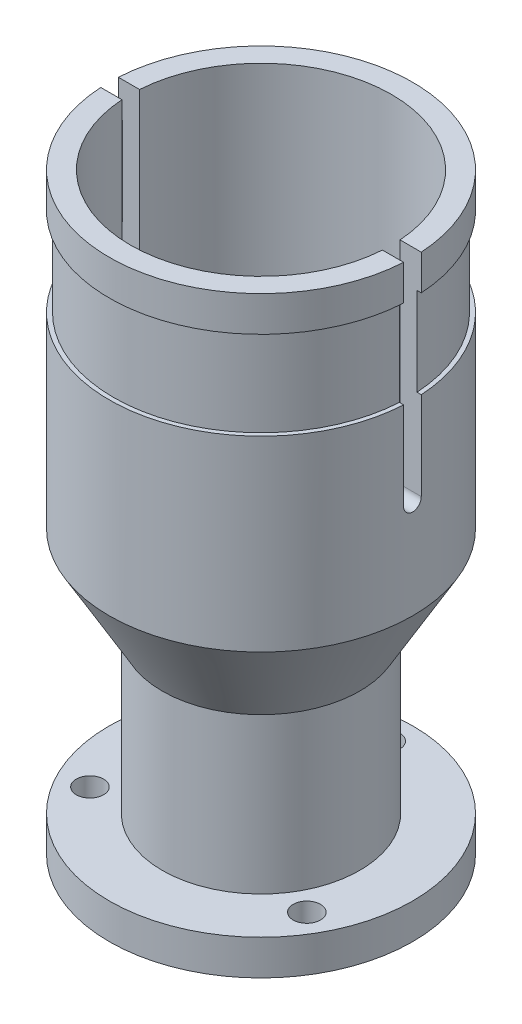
ISO-10303-21;
HEADER;
FILE_DESCRIPTION(('STEP AP214'),'2;1');
FILE_NAME('part.step','',(''),(''),'','','');
FILE_SCHEMA(('AUTOMOTIVE_DESIGN { 1 0 10303 214 1 1 1 1 }'));
ENDSEC;
DATA;
#1=APPLICATION_CONTEXT('core data for automotive mechanical design processes');
#2=APPLICATION_PROTOCOL_DEFINITION('international standard','automotive_design',2000,#1);
#3=PRODUCT_CONTEXT('',#1,'mechanical');
#4=PRODUCT('Part','Part','',(#3));
#5=PRODUCT_RELATED_PRODUCT_CATEGORY('part','',(#4));
#6=PRODUCT_DEFINITION_FORMATION('','',#4);
#7=PRODUCT_DEFINITION_CONTEXT('part definition',#1,'design');
#8=PRODUCT_DEFINITION('design','',#6,#7);
#9=PRODUCT_DEFINITION_SHAPE('','',#8);
#10=(LENGTH_UNIT() NAMED_UNIT(*) SI_UNIT(.MILLI.,.METRE.));
#11=(NAMED_UNIT(*) PLANE_ANGLE_UNIT() SI_UNIT($,.RADIAN.));
#12=(NAMED_UNIT(*) SI_UNIT($,.STERADIAN.) SOLID_ANGLE_UNIT());
#13=UNCERTAINTY_MEASURE_WITH_UNIT(LENGTH_MEASURE(1.E-05),#10,'distance_accuracy_value','');
#14=(GEOMETRIC_REPRESENTATION_CONTEXT(3) GLOBAL_UNCERTAINTY_ASSIGNED_CONTEXT((#13)) GLOBAL_UNIT_ASSIGNED_CONTEXT((#10,
#11,#12)) REPRESENTATION_CONTEXT('',''));
#15=CARTESIAN_POINT('',(0.,0.,0.));
#16=DIRECTION('',(0.,0.,1.));
#17=DIRECTION('',(1.,0.,0.));
#18=AXIS2_PLACEMENT_3D('',#15,#16,#17);
#19=CARTESIAN_POINT('',(-23.495,106.68,0.));
#20=DIRECTION('',(0.,-1.,0.));
#21=DIRECTION('',(0.,0.,-1.));
#22=AXIS2_PLACEMENT_3D('',#19,#20,#21);
#23=PLANE('',#22);
#24=CARTESIAN_POINT('',(0.,106.68,0.));
#25=DIRECTION('',(0.,-1.,0.));
#26=DIRECTION('',(0.,0.,-1.));
#27=AXIS2_PLACEMENT_3D('',#24,#25,#26);
#28=CIRCLE('',#27,27.305);
#29=CARTESIAN_POINT('',(27.2588126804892,106.68,1.5875));
#30=VERTEX_POINT('',#29);
#31=CARTESIAN_POINT('',(-27.2588126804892,106.68,1.5875));
#32=VERTEX_POINT('',#31);
#33=EDGE_CURVE('E223',#30,#32,#28,.T.);
#34=ORIENTED_EDGE('',*,*,#33,.F.);
#35=DIRECTION('',(-1.,0.,0.));
#36=VECTOR('',#35,1.);
#37=CARTESIAN_POINT('',(-23.495,106.68,1.5875));
#38=LINE('',#37,#36);
#39=CARTESIAN_POINT('',(23.4413068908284,106.68,1.5875));
#40=VERTEX_POINT('',#39);
#41=EDGE_CURVE('E277',#30,#40,#38,.T.);
#42=ORIENTED_EDGE('',*,*,#41,.T.);
#43=CARTESIAN_POINT('',(0.,106.68,0.));
#44=DIRECTION('',(0.,-1.,0.));
#45=DIRECTION('',(0.,0.,-1.));
#46=AXIS2_PLACEMENT_3D('',#43,#44,#45);
#47=CIRCLE('',#46,23.495);
#48=CARTESIAN_POINT('',(-23.4413068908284,106.68,1.5875));
#49=VERTEX_POINT('',#48);
#50=EDGE_CURVE('E268',#40,#49,#47,.T.);
#51=ORIENTED_EDGE('',*,*,#50,.T.);
#52=EDGE_CURVE('E276',#49,#32,#38,.T.);
#53=ORIENTED_EDGE('',*,*,#52,.T.);
#54=EDGE_LOOP('',(#34,#42,#51,#53));
#55=FACE_BOUND('',#54,.T.);
#56=ADVANCED_FACE('F35',(#55),#23,.F.);
#57=CARTESIAN_POINT('',(0.,0.,0.));
#58=DIRECTION('',(0.,-1.,0.));
#59=DIRECTION('',(0.,0.,-1.));
#60=AXIS2_PLACEMENT_3D('',#57,#58,#59);
#61=CYLINDRICAL_SURFACE('',#60,27.305);
#62=ORIENTED_EDGE('',*,*,#33,.T.);
#63=DIRECTION('',(0.,-1.,0.));
#64=VECTOR('',#63,1.);
#65=CARTESIAN_POINT('',(-27.2588126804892,0.,1.5875));
#66=LINE('',#65,#64);
#67=CARTESIAN_POINT('',(-27.2588126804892,100.33,1.5875));
#68=VERTEX_POINT('',#67);
#69=EDGE_CURVE('E329',#32,#68,#66,.T.);
#70=ORIENTED_EDGE('',*,*,#69,.T.);
#71=CARTESIAN_POINT('',(0.,100.33,0.));
#72=DIRECTION('',(0.,-1.,0.));
#73=DIRECTION('',(0.,0.,-1.));
#74=AXIS2_PLACEMENT_3D('',#71,#72,#73);
#75=CIRCLE('',#74,27.305);
#76=CARTESIAN_POINT('',(27.2588126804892,100.33,1.5875));
#77=VERTEX_POINT('',#76);
#78=EDGE_CURVE('E230',#77,#68,#75,.T.);
#79=ORIENTED_EDGE('',*,*,#78,.F.);
#80=DIRECTION('',(0.,-1.,0.));
#81=VECTOR('',#80,1.);
#82=CARTESIAN_POINT('',(27.2588126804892,0.,1.5875));
#83=LINE('',#82,#81);
#84=EDGE_CURVE('E316',#77,#30,#83,.F.);
#85=ORIENTED_EDGE('',*,*,#84,.T.);
#86=EDGE_LOOP('',(#62,#70,#79,#85));
#87=FACE_BOUND('',#86,.T.);
#88=ADVANCED_FACE('F369',(#87),#61,.T.);
#89=CARTESIAN_POINT('',(-27.305,100.33,0.));
#90=DIRECTION('',(0.,1.,0.));
#91=DIRECTION('',(0.,0.,1.));
#92=AXIS2_PLACEMENT_3D('',#89,#90,#91);
#93=PLANE('',#92);
#94=ORIENTED_EDGE('',*,*,#78,.T.);
#95=DIRECTION('',(1.,0.,0.));
#96=VECTOR('',#95,1.);
#97=CARTESIAN_POINT('',(-27.305,100.33,1.5875));
#98=LINE('',#97,#96);
#99=CARTESIAN_POINT('',(-26.4954843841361,100.33,1.5875));
#100=VERTEX_POINT('',#99);
#101=EDGE_CURVE('E322',#68,#100,#98,.T.);
#102=ORIENTED_EDGE('',*,*,#101,.T.);
#103=CARTESIAN_POINT('',(0.,100.33,0.));
#104=DIRECTION('',(0.,-1.,0.));
#105=DIRECTION('',(0.,0.,-1.));
#106=AXIS2_PLACEMENT_3D('',#103,#104,#105);
#107=CIRCLE('',#106,26.543);
#108=CARTESIAN_POINT('',(26.4954843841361,100.33,1.5875));
#109=VERTEX_POINT('',#108);
#110=EDGE_CURVE('E234',#109,#100,#107,.T.);
#111=ORIENTED_EDGE('',*,*,#110,.F.);
#112=EDGE_CURVE('E318',#109,#77,#98,.T.);
#113=ORIENTED_EDGE('',*,*,#112,.T.);
#114=EDGE_LOOP('',(#94,#102,#111,#113));
#115=FACE_BOUND('',#114,.T.);
#116=ADVANCED_FACE('F342',(#115),#93,.F.);
#117=CARTESIAN_POINT('',(0.,0.,0.));
#118=DIRECTION('',(0.,-1.,0.));
#119=DIRECTION('',(0.,0.,-1.));
#120=AXIS2_PLACEMENT_3D('',#117,#118,#119);
#121=CYLINDRICAL_SURFACE('',#120,26.543);
#122=ORIENTED_EDGE('',*,*,#110,.T.);
#123=DIRECTION('',(0.,-1.,0.));
#124=VECTOR('',#123,1.);
#125=CARTESIAN_POINT('',(-26.4954843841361,0.,1.5875));
#126=LINE('',#125,#124);
#127=CARTESIAN_POINT('',(-26.4954843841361,84.455,1.5875));
#128=VERTEX_POINT('',#127);
#129=EDGE_CURVE('E331',#100,#128,#126,.T.);
#130=ORIENTED_EDGE('',*,*,#129,.T.);
#131=CARTESIAN_POINT('',(0.,84.455,0.));
#132=DIRECTION('',(0.,-1.,0.));
#133=DIRECTION('',(0.,0.,-1.));
#134=AXIS2_PLACEMENT_3D('',#131,#132,#133);
#135=CIRCLE('',#134,26.543);
#136=CARTESIAN_POINT('',(26.4954843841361,84.455,1.5875));
#137=VERTEX_POINT('',#136);
#138=EDGE_CURVE('E238',#137,#128,#135,.T.);
#139=ORIENTED_EDGE('',*,*,#138,.F.);
#140=DIRECTION('',(0.,-1.,0.));
#141=VECTOR('',#140,1.);
#142=CARTESIAN_POINT('',(26.4954843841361,0.,1.5875));
#143=LINE('',#142,#141);
#144=EDGE_CURVE('E321',#137,#109,#143,.F.);
#145=ORIENTED_EDGE('',*,*,#144,.T.);
#146=EDGE_LOOP('',(#122,#130,#139,#145));
#147=FACE_BOUND('',#146,.T.);
#148=ADVANCED_FACE('F345',(#147),#121,.T.);
#149=CARTESIAN_POINT('',(-26.543,84.455,0.));
#150=DIRECTION('',(0.,-1.,0.));
#151=DIRECTION('',(0.,0.,-1.));
#152=AXIS2_PLACEMENT_3D('',#149,#150,#151);
#153=PLANE('',#152);
#154=CARTESIAN_POINT('',(0.,84.455,0.));
#155=DIRECTION('',(0.,-1.,0.));
#156=DIRECTION('',(0.,0.,-1.));
#157=AXIS2_PLACEMENT_3D('',#154,#155,#156);
#158=CIRCLE('',#157,27.305);
#159=CARTESIAN_POINT('',(27.2588126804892,84.455,1.5875));
#160=VERTEX_POINT('',#159);
#161=CARTESIAN_POINT('',(-27.2588126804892,84.455,1.5875));
#162=VERTEX_POINT('',#161);
#163=EDGE_CURVE('E242',#160,#162,#158,.T.);
#164=ORIENTED_EDGE('',*,*,#163,.F.);
#165=DIRECTION('',(-1.,0.,0.));
#166=VECTOR('',#165,1.);
#167=CARTESIAN_POINT('',(-26.543,84.455,1.5875));
#168=LINE('',#167,#166);
#169=EDGE_CURVE('E325',#160,#137,#168,.T.);
#170=ORIENTED_EDGE('',*,*,#169,.T.);
#171=ORIENTED_EDGE('',*,*,#138,.T.);
#172=EDGE_CURVE('E175',#128,#162,#168,.T.);
#173=ORIENTED_EDGE('',*,*,#172,.T.);
#174=EDGE_LOOP('',(#164,#170,#171,#173));
#175=FACE_BOUND('',#174,.T.);
#176=ADVANCED_FACE('F348',(#175),#153,.F.);
#177=CARTESIAN_POINT('',(-27.2588126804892,106.68,-1.5875));
#178=VERTEX_POINT('',#177);
#179=CARTESIAN_POINT('',(27.2588126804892,106.68,-1.5875));
#180=VERTEX_POINT('',#179);
#181=EDGE_CURVE('E226',#178,#180,#28,.T.);
#182=ORIENTED_EDGE('',*,*,#181,.F.);
#183=DIRECTION('',(1.,0.,0.));
#184=VECTOR('',#183,1.);
#185=CARTESIAN_POINT('',(-23.495,106.68,-1.5875));
#186=LINE('',#185,#184);
#187=CARTESIAN_POINT('',(-23.4413068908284,106.68,-1.5875));
#188=VERTEX_POINT('',#187);
#189=EDGE_CURVE('E287',#178,#188,#186,.T.);
#190=ORIENTED_EDGE('',*,*,#189,.T.);
#191=CARTESIAN_POINT('',(23.4413068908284,106.68,-1.5875));
#192=VERTEX_POINT('',#191);
#193=EDGE_CURVE('E173',#188,#192,#47,.T.);
#194=ORIENTED_EDGE('',*,*,#193,.T.);
#195=EDGE_CURVE('E58',#192,#180,#186,.T.);
#196=ORIENTED_EDGE('',*,*,#195,.T.);
#197=EDGE_LOOP('',(#182,#190,#194,#196));
#198=FACE_BOUND('',#197,.T.);
#199=ADVANCED_FACE('F37',(#198),#23,.F.);
#200=ORIENTED_EDGE('',*,*,#181,.T.);
#201=DIRECTION('',(0.,-1.,0.));
#202=VECTOR('',#201,1.);
#203=CARTESIAN_POINT('',(27.2588126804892,0.,-1.5875));
#204=LINE('',#203,#202);
#205=CARTESIAN_POINT('',(27.2588126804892,100.33,-1.5875));
#206=VERTEX_POINT('',#205);
#207=EDGE_CURVE('E306',#180,#206,#204,.T.);
#208=ORIENTED_EDGE('',*,*,#207,.T.);
#209=CARTESIAN_POINT('',(-27.2588126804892,100.33,-1.5875));
#210=VERTEX_POINT('',#209);
#211=EDGE_CURVE('E231',#210,#206,#75,.T.);
#212=ORIENTED_EDGE('',*,*,#211,.F.);
#213=DIRECTION('',(0.,-1.,0.));
#214=VECTOR('',#213,1.);
#215=CARTESIAN_POINT('',(-27.2588126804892,0.,-1.5875));
#216=LINE('',#215,#214);
#217=EDGE_CURVE('E294',#210,#178,#216,.F.);
#218=ORIENTED_EDGE('',*,*,#217,.T.);
#219=EDGE_LOOP('',(#200,#208,#212,#218));
#220=FACE_BOUND('',#219,.T.);
#221=ADVANCED_FACE('F362',(#220),#61,.T.);
#222=ORIENTED_EDGE('',*,*,#211,.T.);
#223=DIRECTION('',(-1.,0.,0.));
#224=VECTOR('',#223,1.);
#225=CARTESIAN_POINT('',(-27.305,100.33,-1.5875));
#226=LINE('',#225,#224);
#227=CARTESIAN_POINT('',(26.4954843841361,100.33,-1.5875));
#228=VERTEX_POINT('',#227);
#229=EDGE_CURVE('E301',#206,#228,#226,.T.);
#230=ORIENTED_EDGE('',*,*,#229,.T.);
#231=CARTESIAN_POINT('',(-26.4954843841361,100.33,-1.5875));
#232=VERTEX_POINT('',#231);
#233=EDGE_CURVE('E235',#232,#228,#107,.T.);
#234=ORIENTED_EDGE('',*,*,#233,.F.);
#235=EDGE_CURVE('E297',#232,#210,#226,.T.);
#236=ORIENTED_EDGE('',*,*,#235,.T.);
#237=EDGE_LOOP('',(#222,#230,#234,#236));
#238=FACE_BOUND('',#237,.T.);
#239=ADVANCED_FACE('F359',(#238),#93,.F.);
#240=ORIENTED_EDGE('',*,*,#233,.T.);
#241=DIRECTION('',(0.,-1.,0.));
#242=VECTOR('',#241,1.);
#243=CARTESIAN_POINT('',(26.4954843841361,0.,-1.5875));
#244=LINE('',#243,#242);
#245=CARTESIAN_POINT('',(26.4954843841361,84.455,-1.5875));
#246=VERTEX_POINT('',#245);
#247=EDGE_CURVE('E309',#228,#246,#244,.T.);
#248=ORIENTED_EDGE('',*,*,#247,.T.);
#249=CARTESIAN_POINT('',(-26.4954843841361,84.455,-1.5875));
#250=VERTEX_POINT('',#249);
#251=EDGE_CURVE('E239',#250,#246,#135,.T.);
#252=ORIENTED_EDGE('',*,*,#251,.F.);
#253=DIRECTION('',(0.,-1.,0.));
#254=VECTOR('',#253,1.);
#255=CARTESIAN_POINT('',(-26.4954843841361,0.,-1.5875));
#256=LINE('',#255,#254);
#257=EDGE_CURVE('E300',#250,#232,#256,.F.);
#258=ORIENTED_EDGE('',*,*,#257,.T.);
#259=EDGE_LOOP('',(#240,#248,#252,#258));
#260=FACE_BOUND('',#259,.T.);
#261=ADVANCED_FACE('F355',(#260),#121,.T.);
#262=CARTESIAN_POINT('',(-27.2588126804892,84.455,-1.5875));
#263=VERTEX_POINT('',#262);
#264=CARTESIAN_POINT('',(27.2588126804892,84.455,-1.5875));
#265=VERTEX_POINT('',#264);
#266=EDGE_CURVE('E243',#263,#265,#158,.T.);
#267=ORIENTED_EDGE('',*,*,#266,.F.);
#268=DIRECTION('',(1.,0.,0.));
#269=VECTOR('',#268,1.);
#270=CARTESIAN_POINT('',(-26.543,84.455,-1.5875));
#271=LINE('',#270,#269);
#272=EDGE_CURVE('E149',#263,#250,#271,.T.);
#273=ORIENTED_EDGE('',*,*,#272,.T.);
#274=ORIENTED_EDGE('',*,*,#251,.T.);
#275=EDGE_CURVE('E304',#246,#265,#271,.T.);
#276=ORIENTED_EDGE('',*,*,#275,.T.);
#277=EDGE_LOOP('',(#267,#273,#274,#276));
#278=FACE_BOUND('',#277,.T.);
#279=ADVANCED_FACE('F352',(#278),#153,.F.);
#280=CARTESIAN_POINT('',(0.,0.,0.));
#281=DIRECTION('',(0.,-1.,0.));
#282=DIRECTION('',(0.,0.,-1.));
#283=AXIS2_PLACEMENT_3D('',#280,#281,#282);
#284=CYLINDRICAL_SURFACE('',#283,27.305);
#285=CARTESIAN_POINT('',(0.,50.8,0.));
#286=DIRECTION('',(0.,-1.,0.));
#287=DIRECTION('',(0.,0.,-1.));
#288=AXIS2_PLACEMENT_3D('',#285,#286,#287);
#289=CIRCLE('',#288,27.305);
#290=CARTESIAN_POINT('',(0.,50.8,-27.305));
#291=VERTEX_POINT('',#290);
#292=EDGE_CURVE('E245',#291,#291,#289,.T.);
#293=ORIENTED_EDGE('',*,*,#292,.F.);
#294=EDGE_LOOP('',(#293));
#295=FACE_BOUND('',#294,.T.);
#296=CARTESIAN_POINT('',(27.2588126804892,68.58,-1.5875));
#297=CARTESIAN_POINT('',(27.2588120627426,68.5353773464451,-1.58749974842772));
#298=CARTESIAN_POINT('',(27.2589223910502,68.4907761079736,-1.5856173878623));
#299=CARTESIAN_POINT('',(27.2593584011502,68.4018935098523,-1.57810817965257));
#300=CARTESIAN_POINT('',(27.2596840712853,68.3576121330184,-1.57248153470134));
#301=CARTESIAN_POINT('',(27.2609728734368,68.2258025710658,-1.55003940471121));
#302=CARTESIAN_POINT('',(27.2622478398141,68.1391585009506,-1.52766157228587));
#303=CARTESIAN_POINT('',(27.2654874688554,67.9708686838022,-1.46869990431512));
#304=CARTESIAN_POINT('',(27.2674524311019,67.8892251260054,-1.43210989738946));
#305=CARTESIAN_POINT('',(27.2718497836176,67.7332408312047,-1.34576952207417));
#306=CARTESIAN_POINT('',(27.2742820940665,67.6588988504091,-1.29602140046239));
#307=CARTESIAN_POINT('',(27.279343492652,67.5195387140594,-1.18471142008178));
#308=CARTESIAN_POINT('',(27.2819727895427,67.4545306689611,-1.12313691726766));
#309=CARTESIAN_POINT('',(27.2871302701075,67.3357575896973,-0.98993933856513));
#310=CARTESIAN_POINT('',(27.2896584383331,67.2819942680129,-0.918314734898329));
#311=CARTESIAN_POINT('',(27.29433026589,67.1872162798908,-0.766997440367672));
#312=CARTESIAN_POINT('',(27.2964736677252,67.1462101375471,-0.687299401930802));
#313=CARTESIAN_POINT('',(27.3001320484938,67.0781671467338,-0.522140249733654));
#314=CARTESIAN_POINT('',(27.3016470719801,67.051129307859,-0.436679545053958));
#315=CARTESIAN_POINT('',(27.3038766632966,67.0118160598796,-0.262518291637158));
#316=CARTESIAN_POINT('',(27.3045921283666,66.9995241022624,-0.1738214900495));
#317=CARTESIAN_POINT('',(27.305145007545,66.9900003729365,0.004381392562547));
#318=CARTESIAN_POINT('',(27.3049824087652,66.9927688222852,0.0938874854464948));
#319=CARTESIAN_POINT('',(27.30379820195,67.0132741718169,0.271051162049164));
#320=CARTESIAN_POINT('',(27.3027776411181,67.0309928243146,0.358710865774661));
#321=CARTESIAN_POINT('',(27.2999936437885,67.0808672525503,0.529809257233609));
#322=CARTESIAN_POINT('',(27.2982302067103,67.1130230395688,0.613247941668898));
#323=CARTESIAN_POINT('',(27.2941571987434,67.190880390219,0.77359645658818));
#324=CARTESIAN_POINT('',(27.2918472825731,67.2365905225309,0.850502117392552));
#325=CARTESIAN_POINT('',(27.286941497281,67.3402506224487,0.995551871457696));
#326=CARTESIAN_POINT('',(27.2843456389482,67.3982001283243,1.06369629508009));
#327=CARTESIAN_POINT('',(27.2791558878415,67.5247876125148,1.18939073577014));
#328=CARTESIAN_POINT('',(27.2765620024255,67.5934398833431,1.24692635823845));
#329=CARTESIAN_POINT('',(27.2716712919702,67.7394639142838,1.3496761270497));
#330=CARTESIAN_POINT('',(27.2693745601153,67.8168383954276,1.39488641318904));
#331=CARTESIAN_POINT('',(27.2653372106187,67.9781293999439,1.47169902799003));
#332=CARTESIAN_POINT('',(27.2635969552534,68.0620501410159,1.50329249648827));
#333=CARTESIAN_POINT('',(27.2608743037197,68.2339527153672,1.55188900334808));
#334=CARTESIAN_POINT('',(27.2598907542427,68.3219281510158,1.56891424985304));
#335=CARTESIAN_POINT('',(27.2591639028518,68.4387489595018,1.58145855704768));
#336=CARTESIAN_POINT('',(27.2590322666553,68.4669763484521,1.58372527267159));
#337=CARTESIAN_POINT('',(27.2588567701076,68.5234653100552,1.58674393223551));
#338=CARTESIAN_POINT('',(27.2588127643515,68.551726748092,1.58749838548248));
#339=CARTESIAN_POINT('',(27.2588126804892,68.58,1.5875));
#340=B_SPLINE_CURVE_WITH_KNOTS('',3,(#296,#297,#298,#299,#300,#301,#302,#303,#304,#305,#306,
#307,#308,#309,#310,#311,#312,#313,#314,#315,#316,#317,#318,#319,#320,#321,#322,#323,#324,#325,
#326,#327,#328,#329,#330,#331,#332,#333,#334,#335,#336,#337,#338,#339),.UNSPECIFIED.,.F.,.F.,(4,
2,2,2,2,2,2,2,2,2,2,2,2,2,2,2,2,2,2,2,2,4),(0.,0.133785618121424,0.267563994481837,
0.534675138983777,0.801902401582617,1.0690840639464,1.3365529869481,1.60406261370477,
1.87175060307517,2.13941960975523,2.4067879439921,2.6741602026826,2.94120658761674,
3.2082531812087,3.47546895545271,3.74267465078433,4.01024027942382,4.27788961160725,
4.54571283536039,4.81312705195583,4.89805412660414,4.98284016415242),.UNSPECIFIED.);
#341=CARTESIAN_POINT('',(27.2588126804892,68.58,-1.5875));
#342=VERTEX_POINT('',#341);
#343=CARTESIAN_POINT('',(27.2588126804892,68.58,1.5875));
#344=VERTEX_POINT('',#343);
#345=EDGE_CURVE('E171',#342,#344,#340,.T.);
#346=ORIENTED_EDGE('',*,*,#345,.T.);
#347=DIRECTION('',(0.,-1.,0.));
#348=VECTOR('',#347,1.);
#349=CARTESIAN_POINT('',(27.2588126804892,0.,1.5875));
#350=LINE('',#349,#348);
#351=EDGE_CURVE('E284',#344,#160,#350,.F.);
#352=ORIENTED_EDGE('',*,*,#351,.T.);
#353=ORIENTED_EDGE('',*,*,#163,.T.);
#354=DIRECTION('',(0.,-1.,0.));
#355=VECTOR('',#354,1.);
#356=CARTESIAN_POINT('',(-27.2588126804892,0.,1.5875));
#357=LINE('',#356,#355);
#358=CARTESIAN_POINT('',(-27.2588126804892,68.58,1.5875));
#359=VERTEX_POINT('',#358);
#360=EDGE_CURVE('E170',#162,#359,#357,.T.);
#361=ORIENTED_EDGE('',*,*,#360,.T.);
#362=CARTESIAN_POINT('',(-27.2588126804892,68.58,1.5875));
#363=CARTESIAN_POINT('',(-27.2588120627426,68.5353773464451,1.58749974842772));
#364=CARTESIAN_POINT('',(-27.2589223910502,68.4907761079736,1.5856173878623));
#365=CARTESIAN_POINT('',(-27.2593584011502,68.4018935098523,1.57810817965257));
#366=CARTESIAN_POINT('',(-27.2596840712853,68.3576121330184,1.57248153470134));
#367=CARTESIAN_POINT('',(-27.2609728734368,68.2258025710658,1.55003940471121));
#368=CARTESIAN_POINT('',(-27.2622478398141,68.1391585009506,1.52766157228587));
#369=CARTESIAN_POINT('',(-27.2654874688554,67.9708686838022,1.46869990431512));
#370=CARTESIAN_POINT('',(-27.2674524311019,67.8892251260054,1.43210989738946));
#371=CARTESIAN_POINT('',(-27.2718497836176,67.7332408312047,1.34576952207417));
#372=CARTESIAN_POINT('',(-27.2742820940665,67.6588988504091,1.29602140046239));
#373=CARTESIAN_POINT('',(-27.279343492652,67.5195387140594,1.18471142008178));
#374=CARTESIAN_POINT('',(-27.2819727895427,67.4545306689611,1.12313691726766));
#375=CARTESIAN_POINT('',(-27.2871302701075,67.3357575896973,0.98993933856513));
#376=CARTESIAN_POINT('',(-27.2896584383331,67.2819942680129,0.918314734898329));
#377=CARTESIAN_POINT('',(-27.29433026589,67.1872162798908,0.766997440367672));
#378=CARTESIAN_POINT('',(-27.2964736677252,67.1462101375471,0.687299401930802));
#379=CARTESIAN_POINT('',(-27.3001320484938,67.0781671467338,0.522140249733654));
#380=CARTESIAN_POINT('',(-27.3016470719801,67.051129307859,0.436679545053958));
#381=CARTESIAN_POINT('',(-27.3038766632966,67.0118160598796,0.262518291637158));
#382=CARTESIAN_POINT('',(-27.3045921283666,66.9995241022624,0.1738214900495));
#383=CARTESIAN_POINT('',(-27.305145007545,66.9900003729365,-0.004381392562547));
#384=CARTESIAN_POINT('',(-27.3049824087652,66.9927688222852,-0.0938874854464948));
#385=CARTESIAN_POINT('',(-27.30379820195,67.0132741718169,-0.271051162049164));
#386=CARTESIAN_POINT('',(-27.3027776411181,67.0309928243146,-0.358710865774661));
#387=CARTESIAN_POINT('',(-27.2999936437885,67.0808672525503,-0.529809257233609));
#388=CARTESIAN_POINT('',(-27.2982302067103,67.1130230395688,-0.613247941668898));
#389=CARTESIAN_POINT('',(-27.2941571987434,67.190880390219,-0.77359645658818));
#390=CARTESIAN_POINT('',(-27.2918472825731,67.2365905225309,-0.850502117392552));
#391=CARTESIAN_POINT('',(-27.286941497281,67.3402506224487,-0.995551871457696));
#392=CARTESIAN_POINT('',(-27.2843456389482,67.3982001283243,-1.06369629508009));
#393=CARTESIAN_POINT('',(-27.2791558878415,67.5247876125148,-1.18939073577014));
#394=CARTESIAN_POINT('',(-27.2765620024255,67.5934398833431,-1.24692635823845));
#395=CARTESIAN_POINT('',(-27.2716712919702,67.7394639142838,-1.3496761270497));
#396=CARTESIAN_POINT('',(-27.2693745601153,67.8168383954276,-1.39488641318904));
#397=CARTESIAN_POINT('',(-27.2653372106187,67.9781293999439,-1.47169902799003));
#398=CARTESIAN_POINT('',(-27.2635969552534,68.0620501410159,-1.50329249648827));
#399=CARTESIAN_POINT('',(-27.2608743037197,68.2339527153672,-1.55188900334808));
#400=CARTESIAN_POINT('',(-27.2598907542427,68.3219281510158,-1.56891424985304));
#401=CARTESIAN_POINT('',(-27.2591639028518,68.4387489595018,-1.58145855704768));
#402=CARTESIAN_POINT('',(-27.2590322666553,68.4669763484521,-1.58372527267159));
#403=CARTESIAN_POINT('',(-27.2588567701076,68.5234653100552,-1.58674393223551));
#404=CARTESIAN_POINT('',(-27.2588127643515,68.551726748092,-1.58749838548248));
#405=CARTESIAN_POINT('',(-27.2588126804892,68.58,-1.5875));
#406=B_SPLINE_CURVE_WITH_KNOTS('',3,(#362,#363,#364,#365,#366,#367,#368,#369,#370,#371,#372,
#373,#374,#375,#376,#377,#378,#379,#380,#381,#382,#383,#384,#385,#386,#387,#388,#389,#390,#391,
#392,#393,#394,#395,#396,#397,#398,#399,#400,#401,#402,#403,#404,#405),.UNSPECIFIED.,.F.,.F.,(4,
2,2,2,2,2,2,2,2,2,2,2,2,2,2,2,2,2,2,2,2,4),(0.,0.133785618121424,0.267563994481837,
0.534675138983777,0.801902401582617,1.0690840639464,1.3365529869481,1.60406261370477,
1.87175060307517,2.13941960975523,2.4067879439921,2.6741602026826,2.94120658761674,
3.2082531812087,3.47546895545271,3.74267465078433,4.01024027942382,4.27788961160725,
4.54571283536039,4.81312705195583,4.89805412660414,4.98284016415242),.UNSPECIFIED.);
#407=CARTESIAN_POINT('',(-27.2588126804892,68.58,-1.5875));
#408=VERTEX_POINT('',#407);
#409=EDGE_CURVE('E158',#359,#408,#406,.T.);
#410=ORIENTED_EDGE('',*,*,#409,.T.);
#411=DIRECTION('',(0.,-1.,0.));
#412=VECTOR('',#411,1.);
#413=CARTESIAN_POINT('',(-27.2588126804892,0.,-1.5875));
#414=LINE('',#413,#412);
#415=EDGE_CURVE('E146',#408,#263,#414,.F.);
#416=ORIENTED_EDGE('',*,*,#415,.T.);
#417=ORIENTED_EDGE('',*,*,#266,.T.);
#418=DIRECTION('',(0.,-1.,0.));
#419=VECTOR('',#418,1.);
#420=CARTESIAN_POINT('',(27.2588126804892,0.,-1.5875));
#421=LINE('',#420,#419);
#422=EDGE_CURVE('E312',#265,#342,#421,.T.);
#423=ORIENTED_EDGE('',*,*,#422,.T.);
#424=EDGE_LOOP('',(#346,#352,#353,#361,#410,#416,#417,#423));
#425=FACE_BOUND('',#424,.T.);
#426=ADVANCED_FACE('F168',(#295,#425),#284,.T.);
#427=CARTESIAN_POINT('',(0.,50.8,0.));
#428=DIRECTION('',(0.,1.,0.));
#429=DIRECTION('',(0.,0.,1.));
#430=AXIS2_PLACEMENT_3D('',#427,#428,#429);
#431=CONICAL_SURFACE('',#430,27.305,0.523598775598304);
#432=CARTESIAN_POINT('',(0.,34.3022160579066,0.));
#433=DIRECTION('',(0.,-1.,0.));
#434=DIRECTION('',(0.,0.,-1.));
#435=AXIS2_PLACEMENT_3D('',#432,#433,#434);
#436=CIRCLE('',#435,17.78);
#437=CARTESIAN_POINT('',(0.,34.3022160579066,-17.78));
#438=VERTEX_POINT('',#437);
#439=EDGE_CURVE('E248',#438,#438,#436,.T.);
#440=ORIENTED_EDGE('',*,*,#439,.F.);
#441=EDGE_LOOP('',(#440));
#442=FACE_BOUND('',#441,.T.);
#443=ORIENTED_EDGE('',*,*,#292,.T.);
#444=EDGE_LOOP('',(#443));
#445=FACE_BOUND('',#444,.T.);
#446=ADVANCED_FACE('F386',(#442,#445),#431,.T.);
#447=CARTESIAN_POINT('',(0.,0.,0.));
#448=DIRECTION('',(0.,-1.,0.));
#449=DIRECTION('',(0.,0.,-1.));
#450=AXIS2_PLACEMENT_3D('',#447,#448,#449);
#451=CYLINDRICAL_SURFACE('',#450,17.78);
#452=CARTESIAN_POINT('',(0.,6.35,0.));
#453=DIRECTION('',(0.,-1.,0.));
#454=DIRECTION('',(0.,0.,-1.));
#455=AXIS2_PLACEMENT_3D('',#452,#453,#454);
#456=CIRCLE('',#455,17.78);
#457=CARTESIAN_POINT('',(0.,6.35,-17.78));
#458=VERTEX_POINT('',#457);
#459=EDGE_CURVE('E251',#458,#458,#456,.T.);
#460=ORIENTED_EDGE('',*,*,#459,.F.);
#461=EDGE_LOOP('',(#460));
#462=FACE_BOUND('',#461,.T.);
#463=ORIENTED_EDGE('',*,*,#439,.T.);
#464=EDGE_LOOP('',(#463));
#465=FACE_BOUND('',#464,.T.);
#466=ADVANCED_FACE('F391',(#462,#465),#451,.T.);
#467=CARTESIAN_POINT('',(-17.78,6.35,0.));
#468=DIRECTION('',(0.,-1.,0.));
#469=DIRECTION('',(0.,0.,-1.));
#470=AXIS2_PLACEMENT_3D('',#467,#468,#469);
#471=PLANE('',#470);
#472=CARTESIAN_POINT('',(-19.5223776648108,6.35,11.2712499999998));
#473=DIRECTION('',(0.,1.,0.));
#474=DIRECTION('',(0.,0.,1.));
#475=AXIS2_PLACEMENT_3D('',#472,#473,#474);
#476=CIRCLE('',#475,2.45744999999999);
#477=CARTESIAN_POINT('',(-19.5223776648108,6.35,13.7286999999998));
#478=VERTEX_POINT('',#477);
#479=EDGE_CURVE('E470',#478,#478,#476,.T.);
#480=ORIENTED_EDGE('',*,*,#479,.F.);
#481=EDGE_LOOP('',(#480));
#482=FACE_BOUND('',#481,.T.);
#483=CARTESIAN_POINT('',(19.5223776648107,6.35,11.2712500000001));
#484=DIRECTION('',(0.,1.,0.));
#485=DIRECTION('',(0.,0.,1.));
#486=AXIS2_PLACEMENT_3D('',#483,#484,#485);
#487=CIRCLE('',#486,2.45744999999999);
#488=CARTESIAN_POINT('',(19.5223776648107,6.35,13.7287000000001));
#489=VERTEX_POINT('',#488);
#490=EDGE_CURVE('E472',#489,#489,#487,.T.);
#491=ORIENTED_EDGE('',*,*,#490,.F.);
#492=EDGE_LOOP('',(#491));
#493=FACE_BOUND('',#492,.T.);
#494=CARTESIAN_POINT('',(0.,6.35,-22.5425));
#495=DIRECTION('',(0.,1.,0.));
#496=DIRECTION('',(0.,0.,1.));
#497=AXIS2_PLACEMENT_3D('',#494,#495,#496);
#498=CIRCLE('',#497,2.45744999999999);
#499=CARTESIAN_POINT('',(0.,6.35,-20.08505));
#500=VERTEX_POINT('',#499);
#501=EDGE_CURVE('E479',#500,#500,#498,.T.);
#502=ORIENTED_EDGE('',*,*,#501,.F.);
#503=EDGE_LOOP('',(#502));
#504=FACE_BOUND('',#503,.T.);
#505=CARTESIAN_POINT('',(0.,6.35,0.));
#506=DIRECTION('',(0.,-1.,0.));
#507=DIRECTION('',(0.,0.,-1.));
#508=AXIS2_PLACEMENT_3D('',#505,#506,#507);
#509=CIRCLE('',#508,27.305);
#510=CARTESIAN_POINT('',(0.,6.35,-27.305));
#511=VERTEX_POINT('',#510);
#512=EDGE_CURVE('E254',#511,#511,#509,.T.);
#513=ORIENTED_EDGE('',*,*,#512,.F.);
#514=EDGE_LOOP('',(#513));
#515=FACE_BOUND('',#514,.T.);
#516=ORIENTED_EDGE('',*,*,#459,.T.);
#517=EDGE_LOOP('',(#516));
#518=FACE_BOUND('',#517,.T.);
#519=ADVANCED_FACE('F398',(#482,#493,#504,#515,#518),#471,.F.);
#520=CARTESIAN_POINT('',(0.,0.,0.));
#521=DIRECTION('',(0.,-1.,0.));
#522=DIRECTION('',(0.,0.,-1.));
#523=AXIS2_PLACEMENT_3D('',#520,#521,#522);
#524=CYLINDRICAL_SURFACE('',#523,27.305);
#525=CARTESIAN_POINT('',(0.,0.,0.));
#526=DIRECTION('',(0.,-1.,0.));
#527=DIRECTION('',(0.,0.,-1.));
#528=AXIS2_PLACEMENT_3D('',#525,#526,#527);
#529=CIRCLE('',#528,27.305);
#530=CARTESIAN_POINT('',(0.,0.,-27.305));
#531=VERTEX_POINT('',#530);
#532=EDGE_CURVE('E257',#531,#531,#529,.T.);
#533=ORIENTED_EDGE('',*,*,#532,.F.);
#534=EDGE_LOOP('',(#533));
#535=FACE_BOUND('',#534,.T.);
#536=ORIENTED_EDGE('',*,*,#512,.T.);
#537=EDGE_LOOP('',(#536));
#538=FACE_BOUND('',#537,.T.);
#539=ADVANCED_FACE('F405',(#535,#538),#524,.T.);
#540=CARTESIAN_POINT('',(-27.305,0.,0.));
#541=DIRECTION('',(0.,1.,0.));
#542=DIRECTION('',(0.,0.,1.));
#543=AXIS2_PLACEMENT_3D('',#540,#541,#542);
#544=PLANE('',#543);
#545=CARTESIAN_POINT('',(-19.5223776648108,0.,11.2712499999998));
#546=DIRECTION('',(0.,1.,0.));
#547=DIRECTION('',(0.,0.,1.));
#548=AXIS2_PLACEMENT_3D('',#545,#546,#547);
#549=CIRCLE('',#548,2.45745);
#550=CARTESIAN_POINT('',(-19.5223776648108,0.,13.7286999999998));
#551=VERTEX_POINT('',#550);
#552=EDGE_CURVE('E467',#551,#551,#549,.T.);
#553=ORIENTED_EDGE('',*,*,#552,.T.);
#554=EDGE_LOOP('',(#553));
#555=FACE_BOUND('',#554,.T.);
#556=CARTESIAN_POINT('',(19.5223776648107,0.,11.2712500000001));
#557=DIRECTION('',(0.,1.,0.));
#558=DIRECTION('',(0.,0.,1.));
#559=AXIS2_PLACEMENT_3D('',#556,#557,#558);
#560=CIRCLE('',#559,2.45745);
#561=CARTESIAN_POINT('',(19.5223776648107,0.,13.7287000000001));
#562=VERTEX_POINT('',#561);
#563=EDGE_CURVE('E477',#562,#562,#560,.T.);
#564=ORIENTED_EDGE('',*,*,#563,.T.);
#565=EDGE_LOOP('',(#564));
#566=FACE_BOUND('',#565,.T.);
#567=CARTESIAN_POINT('',(0.,0.,-22.5425));
#568=DIRECTION('',(0.,1.,0.));
#569=DIRECTION('',(0.,0.,1.));
#570=AXIS2_PLACEMENT_3D('',#567,#568,#569);
#571=CIRCLE('',#570,2.45745);
#572=CARTESIAN_POINT('',(0.,0.,-20.08505));
#573=VERTEX_POINT('',#572);
#574=EDGE_CURVE('E289',#573,#573,#571,.T.);
#575=ORIENTED_EDGE('',*,*,#574,.T.);
#576=EDGE_LOOP('',(#575));
#577=FACE_BOUND('',#576,.T.);
#578=CARTESIAN_POINT('',(0.,0.,0.));
#579=DIRECTION('',(0.,-1.,0.));
#580=DIRECTION('',(0.,0.,-1.));
#581=AXIS2_PLACEMENT_3D('',#578,#579,#580);
#582=CIRCLE('',#581,12.7);
#583=CARTESIAN_POINT('',(0.,0.,-12.7));
#584=VERTEX_POINT('',#583);
#585=EDGE_CURVE('E260',#584,#584,#582,.T.);
#586=ORIENTED_EDGE('',*,*,#585,.F.);
#587=EDGE_LOOP('',(#586));
#588=FACE_BOUND('',#587,.T.);
#589=ORIENTED_EDGE('',*,*,#532,.T.);
#590=EDGE_LOOP('',(#589));
#591=FACE_BOUND('',#590,.T.);
#592=ADVANCED_FACE('F409',(#555,#566,#577,#588,#591),#544,.F.);
#593=CARTESIAN_POINT('',(0.,0.,0.));
#594=DIRECTION('',(0.,-1.,0.));
#595=DIRECTION('',(0.,0.,-1.));
#596=AXIS2_PLACEMENT_3D('',#593,#594,#595);
#597=CYLINDRICAL_SURFACE('',#596,12.7);
#598=CARTESIAN_POINT('',(0.,55.88,0.));
#599=DIRECTION('',(0.,-1.,0.));
#600=DIRECTION('',(0.,0.,-1.));
#601=AXIS2_PLACEMENT_3D('',#598,#599,#600);
#602=CIRCLE('',#601,12.7);
#603=CARTESIAN_POINT('',(0.,55.88,-12.7));
#604=VERTEX_POINT('',#603);
#605=EDGE_CURVE('E263',#604,#604,#602,.T.);
#606=ORIENTED_EDGE('',*,*,#605,.F.);
#607=EDGE_LOOP('',(#606));
#608=FACE_BOUND('',#607,.T.);
#609=ORIENTED_EDGE('',*,*,#585,.T.);
#610=EDGE_LOOP('',(#609));
#611=FACE_BOUND('',#610,.T.);
#612=ADVANCED_FACE('F413',(#608,#611),#597,.F.);
#613=CARTESIAN_POINT('',(-12.7,55.88,0.));
#614=DIRECTION('',(0.,-1.,0.));
#615=DIRECTION('',(0.,0.,-1.));
#616=AXIS2_PLACEMENT_3D('',#613,#614,#615);
#617=PLANE('',#616);
#618=CARTESIAN_POINT('',(0.,55.88,0.));
#619=DIRECTION('',(0.,-1.,0.));
#620=DIRECTION('',(0.,0.,-1.));
#621=AXIS2_PLACEMENT_3D('',#618,#619,#620);
#622=CIRCLE('',#621,23.495);
#623=CARTESIAN_POINT('',(0.,55.88,-23.495));
#624=VERTEX_POINT('',#623);
#625=EDGE_CURVE('E266',#624,#624,#622,.T.);
#626=ORIENTED_EDGE('',*,*,#625,.F.);
#627=EDGE_LOOP('',(#626));
#628=FACE_BOUND('',#627,.T.);
#629=ORIENTED_EDGE('',*,*,#605,.T.);
#630=EDGE_LOOP('',(#629));
#631=FACE_BOUND('',#630,.T.);
#632=ADVANCED_FACE('F416',(#628,#631),#617,.F.);
#633=CARTESIAN_POINT('',(0.,0.,0.));
#634=DIRECTION('',(0.,-1.,0.));
#635=DIRECTION('',(0.,0.,-1.));
#636=AXIS2_PLACEMENT_3D('',#633,#634,#635);
#637=CYLINDRICAL_SURFACE('',#636,23.495);
#638=ORIENTED_EDGE('',*,*,#50,.F.);
#639=DIRECTION('',(0.,-1.,0.));
#640=VECTOR('',#639,1.);
#641=CARTESIAN_POINT('',(23.4413068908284,0.,1.5875));
#642=LINE('',#641,#640);
#643=CARTESIAN_POINT('',(23.4413068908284,68.58,1.5875));
#644=VERTEX_POINT('',#643);
#645=EDGE_CURVE('E11',#40,#644,#642,.T.);
#646=ORIENTED_EDGE('',*,*,#645,.T.);
#647=CARTESIAN_POINT('',(23.4413068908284,68.58,1.5875));
#648=CARTESIAN_POINT('',(23.4413061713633,68.5353914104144,1.58749976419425));
#649=CARTESIAN_POINT('',(23.4414343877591,68.4908042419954,1.58561857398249));
#650=CARTESIAN_POINT('',(23.4419410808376,68.4019499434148,1.57811413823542));
#651=CARTESIAN_POINT('',(23.4423195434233,68.3576827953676,1.57249110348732));
#652=CARTESIAN_POINT('',(23.4438172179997,68.22591816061,1.55006398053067));
#653=CARTESIAN_POINT('',(23.44529876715,68.1393048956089,1.52770171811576));
#654=CARTESIAN_POINT('',(23.449063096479,67.9710763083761,1.46878378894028));
#655=CARTESIAN_POINT('',(23.4513462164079,67.8894631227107,1.43222210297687));
#656=CARTESIAN_POINT('',(23.4564554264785,67.7335333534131,1.34595088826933));
#657=CARTESIAN_POINT('',(23.459281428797,67.6592155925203,1.29624348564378));
#658=CARTESIAN_POINT('',(23.4651632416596,67.5198672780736,1.1850046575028));
#659=CARTESIAN_POINT('',(23.4682193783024,67.4548502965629,1.12345625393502));
#660=CARTESIAN_POINT('',(23.4742144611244,67.3360528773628,0.990309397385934));
#661=CARTESIAN_POINT('',(23.4771533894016,67.2822741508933,0.918709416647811));
#662=CARTESIAN_POINT('',(23.4825855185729,67.187446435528,0.767416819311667));
#663=CARTESIAN_POINT('',(23.4850783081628,67.1464091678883,0.687716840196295));
#664=CARTESIAN_POINT('',(23.4893335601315,67.0783062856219,0.522543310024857));
#665=CARTESIAN_POINT('',(23.4910960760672,67.0512396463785,0.437070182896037));
#666=CARTESIAN_POINT('',(23.4936900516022,67.0118824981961,0.262910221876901));
#667=CARTESIAN_POINT('',(23.4945229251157,66.9995695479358,0.174228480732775));
#668=CARTESIAN_POINT('',(23.4951685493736,66.9899999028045,-0.00394890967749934));
#669=CARTESIAN_POINT('',(23.4949812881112,66.9927433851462,-0.093444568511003));
#670=CARTESIAN_POINT('',(23.4936088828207,67.0131907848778,-0.27055235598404));
#671=CARTESIAN_POINT('',(23.492425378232,67.0308701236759,-0.358167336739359));
#672=CARTESIAN_POINT('',(23.4891955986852,67.0806491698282,-0.52918286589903));
#673=CARTESIAN_POINT('',(23.4871493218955,67.1127489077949,-0.612583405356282));
#674=CARTESIAN_POINT('',(23.4824214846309,67.19048600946,-0.77288339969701));
#675=CARTESIAN_POINT('',(23.4797393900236,67.2361347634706,-0.849777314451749));
#676=CARTESIAN_POINT('',(23.4740418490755,67.339663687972,-0.99481677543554));
#677=CARTESIAN_POINT('',(23.4710264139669,67.397543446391,-1.0629626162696));
#678=CARTESIAN_POINT('',(23.4649946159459,67.5240206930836,-1.18871007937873));
#679=CARTESIAN_POINT('',(23.4619782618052,67.5926379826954,-1.2462917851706));
#680=CARTESIAN_POINT('',(23.4562893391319,67.7386029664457,-1.34913984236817));
#681=CARTESIAN_POINT('',(23.4536168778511,67.815953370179,-1.39440235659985));
#682=CARTESIAN_POINT('',(23.4489173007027,67.9772118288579,-1.4713240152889));
#683=CARTESIAN_POINT('',(23.4468906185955,68.061124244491,-1.50297402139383));
#684=CARTESIAN_POINT('',(23.4437179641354,68.2330245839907,-1.55168255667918));
#685=CARTESIAN_POINT('',(23.4425706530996,68.3210060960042,-1.56876326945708));
#686=CARTESIAN_POINT('',(23.4417197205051,68.4379887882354,-1.58139323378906));
#687=CARTESIAN_POINT('',(23.441564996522,68.4663675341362,-1.58368444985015));
#688=CARTESIAN_POINT('',(23.4413587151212,68.5231603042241,-1.58673575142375));
#689=CARTESIAN_POINT('',(23.4413069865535,68.5515741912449,-1.58749837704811));
#690=CARTESIAN_POINT('',(23.4413068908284,68.58,-1.5875));
#691=B_SPLINE_CURVE_WITH_KNOTS('',3,(#647,#648,#649,#650,#651,#652,#653,#654,#655,#656,#657,
#658,#659,#660,#661,#662,#663,#664,#665,#666,#667,#668,#669,#670,#671,#672,#673,#674,#675,#676,
#677,#678,#679,#680,#681,#682,#683,#684,#685,#686,#687,#688,#689,#690),.UNSPECIFIED.,.F.,.F.,(4,
2,2,2,2,2,2,2,2,2,2,2,2,2,2,2,2,2,2,2,2,4),(0.,0.13374341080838,0.267479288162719,
0.534499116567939,0.801632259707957,1.06872222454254,1.33619804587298,1.6037145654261,
1.87147645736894,2.13921870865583,2.40655318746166,2.67389081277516,2.94078935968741,
3.20768847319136,3.47481260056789,3.74192772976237,4.00954138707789,4.27723830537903,
4.54511465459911,4.81258239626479,4.89796771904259,4.98321103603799),.UNSPECIFIED.);
#692=CARTESIAN_POINT('',(23.4413068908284,68.58,-1.5875));
#693=VERTEX_POINT('',#692);
#694=EDGE_CURVE('E43',#644,#693,#691,.T.);
#695=ORIENTED_EDGE('',*,*,#694,.T.);
#696=DIRECTION('',(0.,-1.,0.));
#697=VECTOR('',#696,1.);
#698=CARTESIAN_POINT('',(23.4413068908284,0.,-1.5875));
#699=LINE('',#698,#697);
#700=EDGE_CURVE('E216',#693,#192,#699,.F.);
#701=ORIENTED_EDGE('',*,*,#700,.T.);
#702=ORIENTED_EDGE('',*,*,#193,.F.);
#703=DIRECTION('',(0.,-1.,0.));
#704=VECTOR('',#703,1.);
#705=CARTESIAN_POINT('',(-23.4413068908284,0.,-1.5875));
#706=LINE('',#705,#704);
#707=CARTESIAN_POINT('',(-23.4413068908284,68.58,-1.5875));
#708=VERTEX_POINT('',#707);
#709=EDGE_CURVE('E222',#188,#708,#706,.T.);
#710=ORIENTED_EDGE('',*,*,#709,.T.);
#711=CARTESIAN_POINT('',(-23.4413068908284,68.58,-1.5875));
#712=CARTESIAN_POINT('',(-23.4413061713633,68.5353914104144,-1.58749976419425));
#713=CARTESIAN_POINT('',(-23.4414343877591,68.4908042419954,-1.58561857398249));
#714=CARTESIAN_POINT('',(-23.4419410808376,68.4019499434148,-1.57811413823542));
#715=CARTESIAN_POINT('',(-23.4423195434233,68.3576827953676,-1.57249110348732));
#716=CARTESIAN_POINT('',(-23.4438172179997,68.22591816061,-1.55006398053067));
#717=CARTESIAN_POINT('',(-23.44529876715,68.1393048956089,-1.52770171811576));
#718=CARTESIAN_POINT('',(-23.449063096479,67.9710763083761,-1.46878378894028));
#719=CARTESIAN_POINT('',(-23.4513462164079,67.8894631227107,-1.43222210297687));
#720=CARTESIAN_POINT('',(-23.4564554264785,67.7335333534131,-1.34595088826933));
#721=CARTESIAN_POINT('',(-23.459281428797,67.6592155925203,-1.29624348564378));
#722=CARTESIAN_POINT('',(-23.4651632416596,67.5198672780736,-1.1850046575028));
#723=CARTESIAN_POINT('',(-23.4682193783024,67.4548502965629,-1.12345625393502));
#724=CARTESIAN_POINT('',(-23.4742144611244,67.3360528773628,-0.990309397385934));
#725=CARTESIAN_POINT('',(-23.4771533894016,67.2822741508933,-0.918709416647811));
#726=CARTESIAN_POINT('',(-23.4825855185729,67.187446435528,-0.767416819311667));
#727=CARTESIAN_POINT('',(-23.4850783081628,67.1464091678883,-0.687716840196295));
#728=CARTESIAN_POINT('',(-23.4893335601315,67.0783062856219,-0.522543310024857));
#729=CARTESIAN_POINT('',(-23.4910960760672,67.0512396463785,-0.437070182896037));
#730=CARTESIAN_POINT('',(-23.4936900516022,67.0118824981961,-0.262910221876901));
#731=CARTESIAN_POINT('',(-23.4945229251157,66.9995695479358,-0.174228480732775));
#732=CARTESIAN_POINT('',(-23.4951685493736,66.9899999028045,0.00394890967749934));
#733=CARTESIAN_POINT('',(-23.4949812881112,66.9927433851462,0.093444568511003));
#734=CARTESIAN_POINT('',(-23.4936088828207,67.0131907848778,0.27055235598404));
#735=CARTESIAN_POINT('',(-23.492425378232,67.0308701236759,0.358167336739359));
#736=CARTESIAN_POINT('',(-23.4891955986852,67.0806491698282,0.52918286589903));
#737=CARTESIAN_POINT('',(-23.4871493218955,67.1127489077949,0.612583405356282));
#738=CARTESIAN_POINT('',(-23.4824214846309,67.19048600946,0.77288339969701));
#739=CARTESIAN_POINT('',(-23.4797393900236,67.2361347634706,0.849777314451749));
#740=CARTESIAN_POINT('',(-23.4740418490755,67.339663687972,0.99481677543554));
#741=CARTESIAN_POINT('',(-23.4710264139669,67.397543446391,1.0629626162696));
#742=CARTESIAN_POINT('',(-23.4649946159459,67.5240206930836,1.18871007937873));
#743=CARTESIAN_POINT('',(-23.4619782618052,67.5926379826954,1.2462917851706));
#744=CARTESIAN_POINT('',(-23.4562893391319,67.7386029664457,1.34913984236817));
#745=CARTESIAN_POINT('',(-23.4536168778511,67.815953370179,1.39440235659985));
#746=CARTESIAN_POINT('',(-23.4489173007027,67.9772118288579,1.4713240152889));
#747=CARTESIAN_POINT('',(-23.4468906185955,68.061124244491,1.50297402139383));
#748=CARTESIAN_POINT('',(-23.4437179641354,68.2330245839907,1.55168255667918));
#749=CARTESIAN_POINT('',(-23.4425706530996,68.3210060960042,1.56876326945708));
#750=CARTESIAN_POINT('',(-23.4417197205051,68.4379887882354,1.58139323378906));
#751=CARTESIAN_POINT('',(-23.441564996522,68.4663675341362,1.58368444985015));
#752=CARTESIAN_POINT('',(-23.4413587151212,68.5231603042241,1.58673575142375));
#753=CARTESIAN_POINT('',(-23.4413069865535,68.5515741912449,1.58749837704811));
#754=CARTESIAN_POINT('',(-23.4413068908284,68.58,1.5875));
#755=B_SPLINE_CURVE_WITH_KNOTS('',3,(#711,#712,#713,#714,#715,#716,#717,#718,#719,#720,#721,
#722,#723,#724,#725,#726,#727,#728,#729,#730,#731,#732,#733,#734,#735,#736,#737,#738,#739,#740,
#741,#742,#743,#744,#745,#746,#747,#748,#749,#750,#751,#752,#753,#754),.UNSPECIFIED.,.F.,.F.,(4,
2,2,2,2,2,2,2,2,2,2,2,2,2,2,2,2,2,2,2,2,4),(0.,0.13374341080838,0.267479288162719,
0.534499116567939,0.801632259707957,1.06872222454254,1.33619804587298,1.6037145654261,
1.87147645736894,2.13921870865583,2.40655318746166,2.67389081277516,2.94078935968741,
3.20768847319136,3.47481260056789,3.74192772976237,4.00954138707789,4.27723830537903,
4.54511465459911,4.81258239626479,4.89796771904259,4.98321103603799),.UNSPECIFIED.);
#756=CARTESIAN_POINT('',(-23.4413068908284,68.58,1.5875));
#757=VERTEX_POINT('',#756);
#758=EDGE_CURVE('E161',#708,#757,#755,.T.);
#759=ORIENTED_EDGE('',*,*,#758,.T.);
#760=DIRECTION('',(0.,-1.,0.));
#761=VECTOR('',#760,1.);
#762=CARTESIAN_POINT('',(-23.4413068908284,0.,1.5875));
#763=LINE('',#762,#761);
#764=EDGE_CURVE('E217',#757,#49,#763,.F.);
#765=ORIENTED_EDGE('',*,*,#764,.T.);
#766=EDGE_LOOP('',(#638,#646,#695,#701,#702,#710,#759,#765));
#767=FACE_BOUND('',#766,.T.);
#768=ORIENTED_EDGE('',*,*,#625,.T.);
#769=EDGE_LOOP('',(#768));
#770=FACE_BOUND('',#769,.T.);
#771=ADVANCED_FACE('F199',(#767,#770),#637,.F.);
#772=CARTESIAN_POINT('',(-50.8,68.58,-1.5875));
#773=DIRECTION('',(0.,0.,-1.));
#774=DIRECTION('',(0.,1.,0.));
#775=AXIS2_PLACEMENT_3D('',#772,#773,#774);
#776=PLANE('',#775);
#777=DIRECTION('',(1.,0.,0.));
#778=VECTOR('',#777,1.);
#779=CARTESIAN_POINT('',(-50.8,68.58,-1.5875));
#780=LINE('',#779,#778);
#781=EDGE_CURVE('E50',#408,#708,#780,.T.);
#782=ORIENTED_EDGE('',*,*,#781,.T.);
#783=ORIENTED_EDGE('',*,*,#709,.F.);
#784=ORIENTED_EDGE('',*,*,#189,.F.);
#785=ORIENTED_EDGE('',*,*,#217,.F.);
#786=ORIENTED_EDGE('',*,*,#235,.F.);
#787=ORIENTED_EDGE('',*,*,#257,.F.);
#788=ORIENTED_EDGE('',*,*,#272,.F.);
#789=ORIENTED_EDGE('',*,*,#415,.F.);
#790=EDGE_LOOP('',(#782,#783,#784,#785,#786,#787,#788,#789));
#791=FACE_BOUND('',#790,.T.);
#792=ADVANCED_FACE('F147',(#791),#776,.F.);
#793=CARTESIAN_POINT('',(-50.8,68.58,1.5875));
#794=DIRECTION('',(0.,0.,1.));
#795=DIRECTION('',(0.,-1.,0.));
#796=AXIS2_PLACEMENT_3D('',#793,#794,#795);
#797=PLANE('',#796);
#798=ORIENTED_EDGE('',*,*,#172,.F.);
#799=ORIENTED_EDGE('',*,*,#129,.F.);
#800=ORIENTED_EDGE('',*,*,#101,.F.);
#801=ORIENTED_EDGE('',*,*,#69,.F.);
#802=ORIENTED_EDGE('',*,*,#52,.F.);
#803=ORIENTED_EDGE('',*,*,#764,.F.);
#804=DIRECTION('',(1.,0.,0.));
#805=VECTOR('',#804,1.);
#806=CARTESIAN_POINT('',(-50.8,68.58,1.5875));
#807=LINE('',#806,#805);
#808=EDGE_CURVE('E285',#359,#757,#807,.T.);
#809=ORIENTED_EDGE('',*,*,#808,.F.);
#810=ORIENTED_EDGE('',*,*,#360,.F.);
#811=EDGE_LOOP('',(#798,#799,#800,#801,#802,#803,#809,#810));
#812=FACE_BOUND('',#811,.T.);
#813=ADVANCED_FACE('F440',(#812),#797,.F.);
#814=CARTESIAN_POINT('',(-50.8,68.58,0.));
#815=DIRECTION('',(1.,0.,0.));
#816=DIRECTION('',(0.,0.,-1.));
#817=AXIS2_PLACEMENT_3D('',#814,#815,#816);
#818=CYLINDRICAL_SURFACE('',#817,1.5875);
#819=ORIENTED_EDGE('',*,*,#808,.T.);
#820=ORIENTED_EDGE('',*,*,#758,.F.);
#821=ORIENTED_EDGE('',*,*,#781,.F.);
#822=ORIENTED_EDGE('',*,*,#409,.F.);
#823=EDGE_LOOP('',(#819,#820,#821,#822));
#824=FACE_BOUND('',#823,.T.);
#825=ADVANCED_FACE('F157',(#824),#818,.F.);
#826=EDGE_CURVE('E164',#693,#342,#780,.T.);
#827=ORIENTED_EDGE('',*,*,#826,.F.);
#828=ORIENTED_EDGE('',*,*,#694,.F.);
#829=EDGE_CURVE('E163',#644,#344,#807,.T.);
#830=ORIENTED_EDGE('',*,*,#829,.T.);
#831=ORIENTED_EDGE('',*,*,#345,.F.);
#832=EDGE_LOOP('',(#827,#828,#830,#831));
#833=FACE_BOUND('',#832,.T.);
#834=ADVANCED_FACE('F190',(#833),#818,.F.);
#835=ORIENTED_EDGE('',*,*,#829,.F.);
#836=ORIENTED_EDGE('',*,*,#645,.F.);
#837=ORIENTED_EDGE('',*,*,#41,.F.);
#838=ORIENTED_EDGE('',*,*,#84,.F.);
#839=ORIENTED_EDGE('',*,*,#112,.F.);
#840=ORIENTED_EDGE('',*,*,#144,.F.);
#841=ORIENTED_EDGE('',*,*,#169,.F.);
#842=ORIENTED_EDGE('',*,*,#351,.F.);
#843=EDGE_LOOP('',(#835,#836,#837,#838,#839,#840,#841,#842));
#844=FACE_BOUND('',#843,.T.);
#845=ADVANCED_FACE('F195',(#844),#797,.F.);
#846=ORIENTED_EDGE('',*,*,#275,.F.);
#847=ORIENTED_EDGE('',*,*,#247,.F.);
#848=ORIENTED_EDGE('',*,*,#229,.F.);
#849=ORIENTED_EDGE('',*,*,#207,.F.);
#850=ORIENTED_EDGE('',*,*,#195,.F.);
#851=ORIENTED_EDGE('',*,*,#700,.F.);
#852=ORIENTED_EDGE('',*,*,#826,.T.);
#853=ORIENTED_EDGE('',*,*,#422,.F.);
#854=EDGE_LOOP('',(#846,#847,#848,#849,#850,#851,#852,#853));
#855=FACE_BOUND('',#854,.T.);
#856=ADVANCED_FACE('F197',(#855),#776,.F.);
#857=CARTESIAN_POINT('',(0.,6.35,-22.5425));
#858=DIRECTION('',(0.,1.,0.));
#859=DIRECTION('',(0.,0.,1.));
#860=AXIS2_PLACEMENT_3D('',#857,#858,#859);
#861=CYLINDRICAL_SURFACE('',#860,2.45744999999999);
#862=ORIENTED_EDGE('',*,*,#574,.F.);
#863=EDGE_LOOP('',(#862));
#864=FACE_BOUND('',#863,.T.);
#865=ORIENTED_EDGE('',*,*,#501,.T.);
#866=EDGE_LOOP('',(#865));
#867=FACE_BOUND('',#866,.T.);
#868=ADVANCED_FACE('F445',(#864,#867),#861,.F.);
#869=CARTESIAN_POINT('',(19.5223776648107,6.35,11.2712500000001));
#870=DIRECTION('',(0.,1.,0.));
#871=DIRECTION('',(0.,0.,1.));
#872=AXIS2_PLACEMENT_3D('',#869,#870,#871);
#873=CYLINDRICAL_SURFACE('',#872,2.45744999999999);
#874=ORIENTED_EDGE('',*,*,#563,.F.);
#875=EDGE_LOOP('',(#874));
#876=FACE_BOUND('',#875,.T.);
#877=ORIENTED_EDGE('',*,*,#490,.T.);
#878=EDGE_LOOP('',(#877));
#879=FACE_BOUND('',#878,.T.);
#880=ADVANCED_FACE('F450',(#876,#879),#873,.F.);
#881=CARTESIAN_POINT('',(-19.5223776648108,6.35,11.2712499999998));
#882=DIRECTION('',(0.,1.,0.));
#883=DIRECTION('',(0.,0.,1.));
#884=AXIS2_PLACEMENT_3D('',#881,#882,#883);
#885=CYLINDRICAL_SURFACE('',#884,2.45744999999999);
#886=ORIENTED_EDGE('',*,*,#552,.F.);
#887=EDGE_LOOP('',(#886));
#888=FACE_BOUND('',#887,.T.);
#889=ORIENTED_EDGE('',*,*,#479,.T.);
#890=EDGE_LOOP('',(#889));
#891=FACE_BOUND('',#890,.T.);
#892=ADVANCED_FACE('F458',(#888,#891),#885,.F.);
#893=CLOSED_SHELL('',(#56,#88,#116,#148,#176,#199,#221,#239,#261,#279,#426,#446,#466,#519,#539,
#592,#612,#632,#771,#792,#813,#825,#834,#845,#856,#868,#880,#892));
#894=MANIFOLD_SOLID_BREP('B2',#893);
#895=ADVANCED_BREP_SHAPE_REPRESENTATION('',(#18,#894),#14);
#896=SHAPE_DEFINITION_REPRESENTATION(#9,#895);
ENDSEC;
END-ISO-10303-21;
